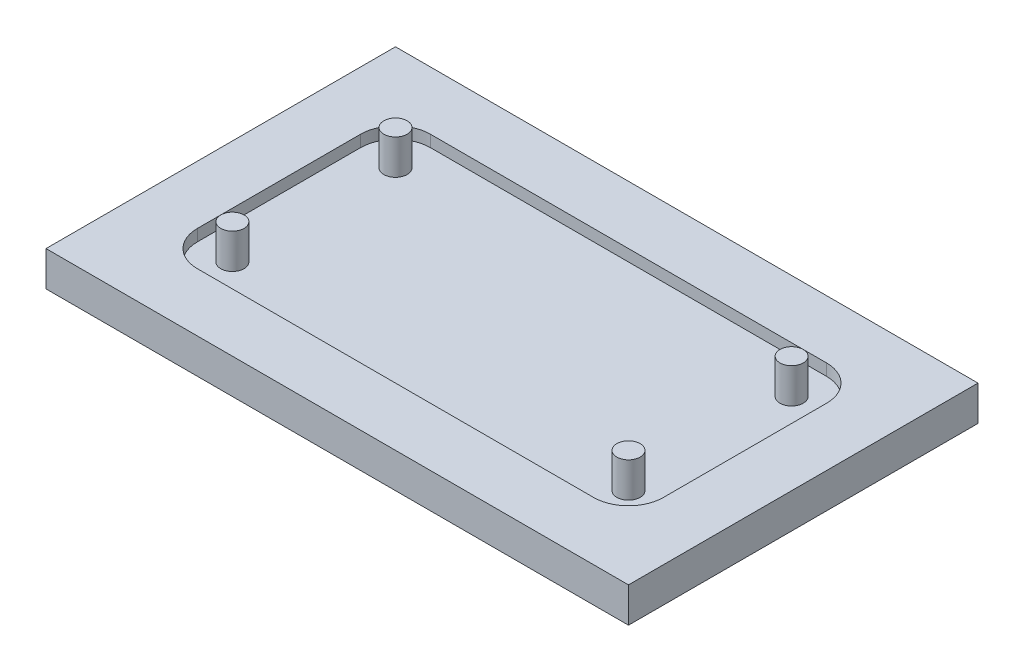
ISO-10303-21;
HEADER;
FILE_DESCRIPTION(('STEP AP214'),'2;1');
FILE_NAME('part.step','',(''),(''),'','','');
FILE_SCHEMA(('AUTOMOTIVE_DESIGN { 1 0 10303 214 1 1 1 1 }'));
ENDSEC;
DATA;
#1=APPLICATION_CONTEXT('core data for automotive mechanical design processes');
#2=APPLICATION_PROTOCOL_DEFINITION('international standard','automotive_design',2000,#1);
#3=PRODUCT_CONTEXT('',#1,'mechanical');
#4=PRODUCT('Part','Part','',(#3));
#5=PRODUCT_RELATED_PRODUCT_CATEGORY('part','',(#4));
#6=PRODUCT_DEFINITION_FORMATION('','',#4);
#7=PRODUCT_DEFINITION_CONTEXT('part definition',#1,'design');
#8=PRODUCT_DEFINITION('design','',#6,#7);
#9=PRODUCT_DEFINITION_SHAPE('','',#8);
#10=(LENGTH_UNIT() NAMED_UNIT(*) SI_UNIT(.MILLI.,.METRE.));
#11=(NAMED_UNIT(*) PLANE_ANGLE_UNIT() SI_UNIT($,.RADIAN.));
#12=(NAMED_UNIT(*) SI_UNIT($,.STERADIAN.) SOLID_ANGLE_UNIT());
#13=UNCERTAINTY_MEASURE_WITH_UNIT(LENGTH_MEASURE(1.E-05),#10,'distance_accuracy_value','');
#14=(GEOMETRIC_REPRESENTATION_CONTEXT(3) GLOBAL_UNCERTAINTY_ASSIGNED_CONTEXT((#13)) GLOBAL_UNIT_ASSIGNED_CONTEXT((#10,
#11,#12)) REPRESENTATION_CONTEXT('',''));
#15=CARTESIAN_POINT('',(0.,0.,0.));
#16=DIRECTION('',(0.,0.,1.));
#17=DIRECTION('',(1.,0.,0.));
#18=AXIS2_PLACEMENT_3D('',#15,#16,#17);
#19=CARTESIAN_POINT('',(85.,10.,-35.));
#20=DIRECTION('',(0.,-1.,0.));
#21=DIRECTION('',(0.,0.,-1.));
#22=AXIS2_PLACEMENT_3D('',#19,#20,#21);
#23=PLANE('',#22);
#24=CARTESIAN_POINT('',(84.9999999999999,10.,35.));
#25=DIRECTION('',(0.,-1.,0.));
#26=DIRECTION('',(0.,0.,-1.));
#27=AXIS2_PLACEMENT_3D('',#24,#25,#26);
#28=CIRCLE('',#27,5.00000000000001);
#29=CARTESIAN_POINT('',(84.9999999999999,10.,30.));
#30=VERTEX_POINT('',#29);
#31=EDGE_CURVE('E11',#30,#30,#28,.F.);
#32=ORIENTED_EDGE('',*,*,#31,.F.);
#33=EDGE_LOOP('',(#32));
#34=FACE_BOUND('',#33,.T.);
#35=CARTESIAN_POINT('',(84.9999999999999,10.,-35.));
#36=DIRECTION('',(0.,-1.,0.));
#37=DIRECTION('',(0.,0.,-1.));
#38=AXIS2_PLACEMENT_3D('',#35,#36,#37);
#39=CIRCLE('',#38,5.00000000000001);
#40=CARTESIAN_POINT('',(84.9999999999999,10.,-40.));
#41=VERTEX_POINT('',#40);
#42=EDGE_CURVE('E48',#41,#41,#39,.F.);
#43=ORIENTED_EDGE('',*,*,#42,.F.);
#44=EDGE_LOOP('',(#43));
#45=FACE_BOUND('',#44,.T.);
#46=CARTESIAN_POINT('',(-85.,10.,35.));
#47=DIRECTION('',(0.,-1.,0.));
#48=DIRECTION('',(0.,0.,-1.));
#49=AXIS2_PLACEMENT_3D('',#46,#47,#48);
#50=CIRCLE('',#49,5.00000000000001);
#51=CARTESIAN_POINT('',(-85.,10.,30.));
#52=VERTEX_POINT('',#51);
#53=EDGE_CURVE('E288',#52,#52,#50,.F.);
#54=ORIENTED_EDGE('',*,*,#53,.F.);
#55=EDGE_LOOP('',(#54));
#56=FACE_BOUND('',#55,.T.);
#57=CARTESIAN_POINT('',(-85.,10.,-35.));
#58=DIRECTION('',(0.,-1.,0.));
#59=DIRECTION('',(0.,0.,-1.));
#60=AXIS2_PLACEMENT_3D('',#57,#58,#59);
#61=CIRCLE('',#60,5.00000000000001);
#62=CARTESIAN_POINT('',(-85.,10.,-40.));
#63=VERTEX_POINT('',#62);
#64=EDGE_CURVE('E284',#63,#63,#61,.F.);
#65=ORIENTED_EDGE('',*,*,#64,.F.);
#66=EDGE_LOOP('',(#65));
#67=FACE_BOUND('',#66,.T.);
#68=DIRECTION('',(1.,0.,0.));
#69=VECTOR('',#68,1.);
#70=CARTESIAN_POINT('',(-84.9999999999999,10.,-50.));
#71=LINE('',#70,#69);
#72=CARTESIAN_POINT('',(-85.,10.,-50.));
#73=VERTEX_POINT('',#72);
#74=CARTESIAN_POINT('',(84.9999999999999,10.,-50.));
#75=VERTEX_POINT('',#74);
#76=EDGE_CURVE('E55',#73,#75,#71,.T.);
#77=ORIENTED_EDGE('',*,*,#76,.F.);
#78=CARTESIAN_POINT('',(-85.,10.,-35.));
#79=DIRECTION('',(0.,-1.,0.));
#80=DIRECTION('',(0.,0.,-1.));
#81=AXIS2_PLACEMENT_3D('',#78,#79,#80);
#82=CIRCLE('',#81,15.);
#83=CARTESIAN_POINT('',(-100.,10.,-34.9999999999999));
#84=VERTEX_POINT('',#83);
#85=EDGE_CURVE('E59',#84,#73,#82,.T.);
#86=ORIENTED_EDGE('',*,*,#85,.F.);
#87=DIRECTION('',(0.,0.,-1.));
#88=VECTOR('',#87,1.);
#89=CARTESIAN_POINT('',(-100.,10.,34.9999999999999));
#90=LINE('',#89,#88);
#91=CARTESIAN_POINT('',(-100.,10.,34.9999999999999));
#92=VERTEX_POINT('',#91);
#93=EDGE_CURVE('E279',#92,#84,#90,.T.);
#94=ORIENTED_EDGE('',*,*,#93,.F.);
#95=CARTESIAN_POINT('',(-85.,10.,35.));
#96=DIRECTION('',(0.,-1.,0.));
#97=DIRECTION('',(0.,0.,-1.));
#98=AXIS2_PLACEMENT_3D('',#95,#96,#97);
#99=CIRCLE('',#98,15.);
#100=CARTESIAN_POINT('',(-84.9999999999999,10.,50.));
#101=VERTEX_POINT('',#100);
#102=EDGE_CURVE('E275',#101,#92,#99,.T.);
#103=ORIENTED_EDGE('',*,*,#102,.F.);
#104=DIRECTION('',(1.,0.,0.));
#105=VECTOR('',#104,1.);
#106=CARTESIAN_POINT('',(-84.9999999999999,10.,50.));
#107=LINE('',#106,#105);
#108=CARTESIAN_POINT('',(84.9999999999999,10.,50.));
#109=VERTEX_POINT('',#108);
#110=EDGE_CURVE('E272',#101,#109,#107,.T.);
#111=ORIENTED_EDGE('',*,*,#110,.T.);
#112=CARTESIAN_POINT('',(85.,10.,35.));
#113=DIRECTION('',(0.,1.,0.));
#114=DIRECTION('',(0.,0.,1.));
#115=AXIS2_PLACEMENT_3D('',#112,#113,#114);
#116=CIRCLE('',#115,15.);
#117=CARTESIAN_POINT('',(100.,10.,34.9999999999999));
#118=VERTEX_POINT('',#117);
#119=EDGE_CURVE('E269',#109,#118,#116,.T.);
#120=ORIENTED_EDGE('',*,*,#119,.T.);
#121=DIRECTION('',(0.,0.,-1.));
#122=VECTOR('',#121,1.);
#123=CARTESIAN_POINT('',(100.,10.,34.9999999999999));
#124=LINE('',#123,#122);
#125=CARTESIAN_POINT('',(100.,10.,-34.9999999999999));
#126=VERTEX_POINT('',#125);
#127=EDGE_CURVE('E266',#118,#126,#124,.T.);
#128=ORIENTED_EDGE('',*,*,#127,.T.);
#129=CARTESIAN_POINT('',(85.,10.,-35.));
#130=DIRECTION('',(0.,-1.,0.));
#131=DIRECTION('',(0.,0.,-1.));
#132=AXIS2_PLACEMENT_3D('',#129,#130,#131);
#133=CIRCLE('',#132,15.);
#134=EDGE_CURVE('E262',#75,#126,#133,.T.);
#135=ORIENTED_EDGE('',*,*,#134,.F.);
#136=EDGE_LOOP('',(#77,#86,#94,#103,#111,#120,#128,#135));
#137=FACE_BOUND('',#136,.T.);
#138=ADVANCED_FACE('F39',(#34,#45,#56,#67,#137),#23,.F.);
#139=CARTESIAN_POINT('',(-85.,25.,-35.));
#140=DIRECTION('',(0.,-1.,0.));
#141=DIRECTION('',(0.,0.,-1.));
#142=AXIS2_PLACEMENT_3D('',#139,#140,#141);
#143=CYLINDRICAL_SURFACE('',#142,5.00000000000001);
#144=CARTESIAN_POINT('',(-85.,25.,-35.));
#145=DIRECTION('',(0.,1.,0.));
#146=DIRECTION('',(0.,0.,1.));
#147=AXIS2_PLACEMENT_3D('',#144,#145,#146);
#148=CIRCLE('',#147,5.00000000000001);
#149=CARTESIAN_POINT('',(-85.,25.,-30.));
#150=VERTEX_POINT('',#149);
#151=EDGE_CURVE('E256',#150,#150,#148,.T.);
#152=ORIENTED_EDGE('',*,*,#151,.F.);
#153=EDGE_LOOP('',(#152));
#154=FACE_BOUND('',#153,.T.);
#155=ORIENTED_EDGE('',*,*,#64,.T.);
#156=EDGE_LOOP('',(#155));
#157=FACE_BOUND('',#156,.T.);
#158=ADVANCED_FACE('F299',(#154,#157),#143,.T.);
#159=CARTESIAN_POINT('',(-85.,25.,-35.));
#160=DIRECTION('',(0.,1.,0.));
#161=DIRECTION('',(0.,0.,1.));
#162=AXIS2_PLACEMENT_3D('',#159,#160,#161);
#163=PLANE('',#162);
#164=ORIENTED_EDGE('',*,*,#151,.T.);
#165=EDGE_LOOP('',(#164));
#166=FACE_BOUND('',#165,.T.);
#167=ADVANCED_FACE('F306',(#166),#163,.T.);
#168=CARTESIAN_POINT('',(-85.,25.,35.));
#169=DIRECTION('',(0.,-1.,0.));
#170=DIRECTION('',(0.,0.,-1.));
#171=AXIS2_PLACEMENT_3D('',#168,#169,#170);
#172=CYLINDRICAL_SURFACE('',#171,5.00000000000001);
#173=CARTESIAN_POINT('',(-85.,25.,35.));
#174=DIRECTION('',(0.,1.,0.));
#175=DIRECTION('',(0.,0.,1.));
#176=AXIS2_PLACEMENT_3D('',#173,#174,#175);
#177=CIRCLE('',#176,5.00000000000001);
#178=CARTESIAN_POINT('',(-85.,25.,40.));
#179=VERTEX_POINT('',#178);
#180=EDGE_CURVE('E252',#179,#179,#177,.T.);
#181=ORIENTED_EDGE('',*,*,#180,.F.);
#182=EDGE_LOOP('',(#181));
#183=FACE_BOUND('',#182,.T.);
#184=ORIENTED_EDGE('',*,*,#53,.T.);
#185=EDGE_LOOP('',(#184));
#186=FACE_BOUND('',#185,.T.);
#187=ADVANCED_FACE('F312',(#183,#186),#172,.T.);
#188=CARTESIAN_POINT('',(-85.,25.,35.));
#189=DIRECTION('',(0.,1.,0.));
#190=DIRECTION('',(0.,0.,1.));
#191=AXIS2_PLACEMENT_3D('',#188,#189,#190);
#192=PLANE('',#191);
#193=ORIENTED_EDGE('',*,*,#180,.T.);
#194=EDGE_LOOP('',(#193));
#195=FACE_BOUND('',#194,.T.);
#196=ADVANCED_FACE('F319',(#195),#192,.T.);
#197=CARTESIAN_POINT('',(84.9999999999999,25.,-35.));
#198=DIRECTION('',(0.,-1.,0.));
#199=DIRECTION('',(0.,0.,-1.));
#200=AXIS2_PLACEMENT_3D('',#197,#198,#199);
#201=CYLINDRICAL_SURFACE('',#200,5.00000000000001);
#202=CARTESIAN_POINT('',(84.9999999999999,25.,-35.));
#203=DIRECTION('',(0.,1.,0.));
#204=DIRECTION('',(0.,0.,1.));
#205=AXIS2_PLACEMENT_3D('',#202,#203,#204);
#206=CIRCLE('',#205,5.00000000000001);
#207=CARTESIAN_POINT('',(84.9999999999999,25.,-30.));
#208=VERTEX_POINT('',#207);
#209=EDGE_CURVE('E248',#208,#208,#206,.T.);
#210=ORIENTED_EDGE('',*,*,#209,.F.);
#211=EDGE_LOOP('',(#210));
#212=FACE_BOUND('',#211,.T.);
#213=ORIENTED_EDGE('',*,*,#42,.T.);
#214=EDGE_LOOP('',(#213));
#215=FACE_BOUND('',#214,.T.);
#216=ADVANCED_FACE('F295',(#212,#215),#201,.T.);
#217=CARTESIAN_POINT('',(84.9999999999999,25.,-35.));
#218=DIRECTION('',(0.,1.,0.));
#219=DIRECTION('',(0.,0.,1.));
#220=AXIS2_PLACEMENT_3D('',#217,#218,#219);
#221=PLANE('',#220);
#222=ORIENTED_EDGE('',*,*,#209,.T.);
#223=EDGE_LOOP('',(#222));
#224=FACE_BOUND('',#223,.T.);
#225=ADVANCED_FACE('F326',(#224),#221,.T.);
#226=CARTESIAN_POINT('',(84.9999999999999,25.,35.));
#227=DIRECTION('',(0.,-1.,0.));
#228=DIRECTION('',(0.,0.,-1.));
#229=AXIS2_PLACEMENT_3D('',#226,#227,#228);
#230=CYLINDRICAL_SURFACE('',#229,5.00000000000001);
#231=CARTESIAN_POINT('',(84.9999999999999,25.,35.));
#232=DIRECTION('',(0.,1.,0.));
#233=DIRECTION('',(0.,0.,1.));
#234=AXIS2_PLACEMENT_3D('',#231,#232,#233);
#235=CIRCLE('',#234,5.00000000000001);
#236=CARTESIAN_POINT('',(84.9999999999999,25.,40.));
#237=VERTEX_POINT('',#236);
#238=EDGE_CURVE('E236',#237,#237,#235,.T.);
#239=ORIENTED_EDGE('',*,*,#238,.F.);
#240=EDGE_LOOP('',(#239));
#241=FACE_BOUND('',#240,.T.);
#242=ORIENTED_EDGE('',*,*,#31,.T.);
#243=EDGE_LOOP('',(#242));
#244=FACE_BOUND('',#243,.T.);
#245=ADVANCED_FACE('F330',(#241,#244),#230,.T.);
#246=CARTESIAN_POINT('',(84.9999999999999,25.,35.));
#247=DIRECTION('',(0.,1.,0.));
#248=DIRECTION('',(0.,0.,1.));
#249=AXIS2_PLACEMENT_3D('',#246,#247,#248);
#250=PLANE('',#249);
#251=ORIENTED_EDGE('',*,*,#238,.T.);
#252=EDGE_LOOP('',(#251));
#253=FACE_BOUND('',#252,.T.);
#254=ADVANCED_FACE('F334',(#253),#250,.T.);
#255=CARTESIAN_POINT('',(-85.,15.,-35.));
#256=DIRECTION('',(0.,-1.,0.));
#257=DIRECTION('',(0.,0.,-1.));
#258=AXIS2_PLACEMENT_3D('',#255,#256,#257);
#259=CYLINDRICAL_SURFACE('',#258,15.);
#260=DIRECTION('',(0.,-1.,0.));
#261=VECTOR('',#260,1.);
#262=CARTESIAN_POINT('',(-100.,15.,-34.9999999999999));
#263=LINE('',#262,#261);
#264=CARTESIAN_POINT('',(-100.,15.,-34.9999999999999));
#265=VERTEX_POINT('',#264);
#266=EDGE_CURVE('E175',#265,#84,#263,.T.);
#267=ORIENTED_EDGE('',*,*,#266,.T.);
#268=ORIENTED_EDGE('',*,*,#85,.T.);
#269=DIRECTION('',(0.,-1.,0.));
#270=VECTOR('',#269,1.);
#271=CARTESIAN_POINT('',(-85.,15.,-50.));
#272=LINE('',#271,#270);
#273=CARTESIAN_POINT('',(-85.,15.,-50.));
#274=VERTEX_POINT('',#273);
#275=EDGE_CURVE('E127',#274,#73,#272,.T.);
#276=ORIENTED_EDGE('',*,*,#275,.F.);
#277=CARTESIAN_POINT('',(-85.,15.,-35.));
#278=DIRECTION('',(0.,-1.,0.));
#279=DIRECTION('',(0.,0.,-1.));
#280=AXIS2_PLACEMENT_3D('',#277,#278,#279);
#281=CIRCLE('',#280,15.);
#282=EDGE_CURVE('E132',#265,#274,#281,.T.);
#283=ORIENTED_EDGE('',*,*,#282,.F.);
#284=EDGE_LOOP('',(#267,#268,#276,#283));
#285=FACE_BOUND('',#284,.T.);
#286=ADVANCED_FACE('F130',(#285),#259,.F.);
#287=CARTESIAN_POINT('',(-100.,15.,34.9999999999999));
#288=DIRECTION('',(-1.,0.,0.));
#289=DIRECTION('',(0.,0.,1.));
#290=AXIS2_PLACEMENT_3D('',#287,#288,#289);
#291=PLANE('',#290);
#292=DIRECTION('',(0.,-1.,0.));
#293=VECTOR('',#292,1.);
#294=CARTESIAN_POINT('',(-100.,15.,34.9999999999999));
#295=LINE('',#294,#293);
#296=CARTESIAN_POINT('',(-100.,15.,34.9999999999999));
#297=VERTEX_POINT('',#296);
#298=EDGE_CURVE('E179',#297,#92,#295,.T.);
#299=ORIENTED_EDGE('',*,*,#298,.T.);
#300=ORIENTED_EDGE('',*,*,#93,.T.);
#301=ORIENTED_EDGE('',*,*,#266,.F.);
#302=DIRECTION('',(0.,0.,-1.));
#303=VECTOR('',#302,1.);
#304=CARTESIAN_POINT('',(-100.,15.,34.9999999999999));
#305=LINE('',#304,#303);
#306=EDGE_CURVE('E137',#297,#265,#305,.T.);
#307=ORIENTED_EDGE('',*,*,#306,.F.);
#308=EDGE_LOOP('',(#299,#300,#301,#307));
#309=FACE_BOUND('',#308,.T.);
#310=ADVANCED_FACE('F359',(#309),#291,.F.);
#311=CARTESIAN_POINT('',(-85.,15.,35.));
#312=DIRECTION('',(0.,-1.,0.));
#313=DIRECTION('',(0.,0.,-1.));
#314=AXIS2_PLACEMENT_3D('',#311,#312,#313);
#315=CYLINDRICAL_SURFACE('',#314,15.);
#316=DIRECTION('',(0.,-1.,0.));
#317=VECTOR('',#316,1.);
#318=CARTESIAN_POINT('',(-84.9999999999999,15.,50.));
#319=LINE('',#318,#317);
#320=CARTESIAN_POINT('',(-84.9999999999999,15.,50.));
#321=VERTEX_POINT('',#320);
#322=EDGE_CURVE('E183',#321,#101,#319,.T.);
#323=ORIENTED_EDGE('',*,*,#322,.T.);
#324=ORIENTED_EDGE('',*,*,#102,.T.);
#325=ORIENTED_EDGE('',*,*,#298,.F.);
#326=CARTESIAN_POINT('',(-85.,15.,35.));
#327=DIRECTION('',(0.,-1.,0.));
#328=DIRECTION('',(0.,0.,-1.));
#329=AXIS2_PLACEMENT_3D('',#326,#327,#328);
#330=CIRCLE('',#329,15.);
#331=EDGE_CURVE('E170',#321,#297,#330,.T.);
#332=ORIENTED_EDGE('',*,*,#331,.F.);
#333=EDGE_LOOP('',(#323,#324,#325,#332));
#334=FACE_BOUND('',#333,.T.);
#335=ADVANCED_FACE('F377',(#334),#315,.F.);
#336=CARTESIAN_POINT('',(84.9999999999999,15.,50.));
#337=DIRECTION('',(0.,0.,1.));
#338=DIRECTION('',(1.,0.,0.));
#339=AXIS2_PLACEMENT_3D('',#336,#337,#338);
#340=PLANE('',#339);
#341=DIRECTION('',(0.,-1.,0.));
#342=VECTOR('',#341,1.);
#343=CARTESIAN_POINT('',(84.9999999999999,15.,50.));
#344=LINE('',#343,#342);
#345=CARTESIAN_POINT('',(84.9999999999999,15.,50.));
#346=VERTEX_POINT('',#345);
#347=EDGE_CURVE('E187',#346,#109,#344,.T.);
#348=ORIENTED_EDGE('',*,*,#347,.T.);
#349=ORIENTED_EDGE('',*,*,#110,.F.);
#350=ORIENTED_EDGE('',*,*,#322,.F.);
#351=DIRECTION('',(-1.,0.,0.));
#352=VECTOR('',#351,1.);
#353=CARTESIAN_POINT('',(84.9999999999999,15.,50.));
#354=LINE('',#353,#352);
#355=EDGE_CURVE('E166',#346,#321,#354,.T.);
#356=ORIENTED_EDGE('',*,*,#355,.F.);
#357=EDGE_LOOP('',(#348,#349,#350,#356));
#358=FACE_BOUND('',#357,.T.);
#359=ADVANCED_FACE('F373',(#358),#340,.F.);
#360=CARTESIAN_POINT('',(85.,15.,35.));
#361=DIRECTION('',(0.,-1.,0.));
#362=DIRECTION('',(0.,0.,-1.));
#363=AXIS2_PLACEMENT_3D('',#360,#361,#362);
#364=CYLINDRICAL_SURFACE('',#363,15.);
#365=DIRECTION('',(0.,-1.,0.));
#366=VECTOR('',#365,1.);
#367=CARTESIAN_POINT('',(100.,15.,34.9999999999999));
#368=LINE('',#367,#366);
#369=CARTESIAN_POINT('',(100.,15.,34.9999999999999));
#370=VERTEX_POINT('',#369);
#371=EDGE_CURVE('E191',#370,#118,#368,.T.);
#372=ORIENTED_EDGE('',*,*,#371,.T.);
#373=ORIENTED_EDGE('',*,*,#119,.F.);
#374=ORIENTED_EDGE('',*,*,#347,.F.);
#375=CARTESIAN_POINT('',(85.,15.,35.));
#376=DIRECTION('',(0.,-1.,0.));
#377=DIRECTION('',(0.,0.,-1.));
#378=AXIS2_PLACEMENT_3D('',#375,#376,#377);
#379=CIRCLE('',#378,15.);
#380=EDGE_CURVE('E162',#370,#346,#379,.T.);
#381=ORIENTED_EDGE('',*,*,#380,.F.);
#382=EDGE_LOOP('',(#372,#373,#374,#381));
#383=FACE_BOUND('',#382,.T.);
#384=ADVANCED_FACE('F369',(#383),#364,.F.);
#385=CARTESIAN_POINT('',(100.,15.,-35.));
#386=DIRECTION('',(1.,0.,0.));
#387=DIRECTION('',(0.,0.,-1.));
#388=AXIS2_PLACEMENT_3D('',#385,#386,#387);
#389=PLANE('',#388);
#390=DIRECTION('',(0.,-1.,0.));
#391=VECTOR('',#390,1.);
#392=CARTESIAN_POINT('',(100.,15.,-35.));
#393=LINE('',#392,#391);
#394=CARTESIAN_POINT('',(100.,15.,-35.));
#395=VERTEX_POINT('',#394);
#396=EDGE_CURVE('E195',#395,#126,#393,.T.);
#397=ORIENTED_EDGE('',*,*,#396,.T.);
#398=ORIENTED_EDGE('',*,*,#127,.F.);
#399=ORIENTED_EDGE('',*,*,#371,.F.);
#400=DIRECTION('',(0.,0.,1.));
#401=VECTOR('',#400,1.);
#402=CARTESIAN_POINT('',(100.,15.,-35.));
#403=LINE('',#402,#401);
#404=EDGE_CURVE('E158',#395,#370,#403,.T.);
#405=ORIENTED_EDGE('',*,*,#404,.F.);
#406=EDGE_LOOP('',(#397,#398,#399,#405));
#407=FACE_BOUND('',#406,.T.);
#408=ADVANCED_FACE('F365',(#407),#389,.F.);
#409=CARTESIAN_POINT('',(85.,15.,-35.));
#410=DIRECTION('',(0.,-1.,0.));
#411=DIRECTION('',(0.,0.,-1.));
#412=AXIS2_PLACEMENT_3D('',#409,#410,#411);
#413=CYLINDRICAL_SURFACE('',#412,15.);
#414=DIRECTION('',(0.,-1.,0.));
#415=VECTOR('',#414,1.);
#416=CARTESIAN_POINT('',(84.9999999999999,15.,-50.));
#417=LINE('',#416,#415);
#418=CARTESIAN_POINT('',(84.9999999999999,15.,-50.));
#419=VERTEX_POINT('',#418);
#420=EDGE_CURVE('E136',#419,#75,#417,.T.);
#421=ORIENTED_EDGE('',*,*,#420,.T.);
#422=ORIENTED_EDGE('',*,*,#134,.T.);
#423=ORIENTED_EDGE('',*,*,#396,.F.);
#424=CARTESIAN_POINT('',(85.,15.,-35.));
#425=DIRECTION('',(0.,-1.,0.));
#426=DIRECTION('',(0.,0.,-1.));
#427=AXIS2_PLACEMENT_3D('',#424,#425,#426);
#428=CIRCLE('',#427,15.);
#429=EDGE_CURVE('E147',#419,#395,#428,.T.);
#430=ORIENTED_EDGE('',*,*,#429,.F.);
#431=EDGE_LOOP('',(#421,#422,#423,#430));
#432=FACE_BOUND('',#431,.T.);
#433=ADVANCED_FACE('F362',(#432),#413,.F.);
#434=CARTESIAN_POINT('',(-85.,15.,-50.));
#435=DIRECTION('',(0.,0.,-1.));
#436=DIRECTION('',(-1.,0.,0.));
#437=AXIS2_PLACEMENT_3D('',#434,#435,#436);
#438=PLANE('',#437);
#439=ORIENTED_EDGE('',*,*,#275,.T.);
#440=ORIENTED_EDGE('',*,*,#76,.T.);
#441=ORIENTED_EDGE('',*,*,#420,.F.);
#442=DIRECTION('',(1.,0.,0.));
#443=VECTOR('',#442,1.);
#444=CARTESIAN_POINT('',(-85.,15.,-50.));
#445=LINE('',#444,#443);
#446=EDGE_CURVE('E141',#274,#419,#445,.T.);
#447=ORIENTED_EDGE('',*,*,#446,.F.);
#448=EDGE_LOOP('',(#439,#440,#441,#447));
#449=FACE_BOUND('',#448,.T.);
#450=ADVANCED_FACE('F142',(#449),#438,.F.);
#451=CARTESIAN_POINT('',(125.,15.,-75.));
#452=DIRECTION('',(1.,0.,0.));
#453=DIRECTION('',(0.,0.,-1.));
#454=AXIS2_PLACEMENT_3D('',#451,#452,#453);
#455=PLANE('',#454);
#456=DIRECTION('',(0.,0.,1.));
#457=VECTOR('',#456,1.);
#458=CARTESIAN_POINT('',(125.,0.,-75.));
#459=LINE('',#458,#457);
#460=CARTESIAN_POINT('',(125.,0.,-75.));
#461=VERTEX_POINT('',#460);
#462=CARTESIAN_POINT('',(125.,0.,75.));
#463=VERTEX_POINT('',#462);
#464=EDGE_CURVE('E178',#461,#463,#459,.T.);
#465=ORIENTED_EDGE('',*,*,#464,.F.);
#466=DIRECTION('',(0.,-1.,0.));
#467=VECTOR('',#466,1.);
#468=CARTESIAN_POINT('',(125.,15.,-75.));
#469=LINE('',#468,#467);
#470=CARTESIAN_POINT('',(125.,15.,-75.));
#471=VERTEX_POINT('',#470);
#472=EDGE_CURVE('E233',#471,#461,#469,.T.);
#473=ORIENTED_EDGE('',*,*,#472,.F.);
#474=DIRECTION('',(0.,0.,1.));
#475=VECTOR('',#474,1.);
#476=CARTESIAN_POINT('',(125.,15.,-75.));
#477=LINE('',#476,#475);
#478=CARTESIAN_POINT('',(125.,15.,75.));
#479=VERTEX_POINT('',#478);
#480=EDGE_CURVE('E201',#471,#479,#477,.T.);
#481=ORIENTED_EDGE('',*,*,#480,.T.);
#482=DIRECTION('',(0.,-1.,0.));
#483=VECTOR('',#482,1.);
#484=CARTESIAN_POINT('',(125.,15.,75.));
#485=LINE('',#484,#483);
#486=EDGE_CURVE('E218',#479,#463,#485,.T.);
#487=ORIENTED_EDGE('',*,*,#486,.T.);
#488=EDGE_LOOP('',(#465,#473,#481,#487));
#489=FACE_BOUND('',#488,.T.);
#490=ADVANCED_FACE('F339',(#489),#455,.T.);
#491=CARTESIAN_POINT('',(-125.,15.,-75.));
#492=DIRECTION('',(0.,0.,-1.));
#493=DIRECTION('',(-1.,0.,0.));
#494=AXIS2_PLACEMENT_3D('',#491,#492,#493);
#495=PLANE('',#494);
#496=DIRECTION('',(1.,0.,0.));
#497=VECTOR('',#496,1.);
#498=CARTESIAN_POINT('',(-125.,0.,-75.));
#499=LINE('',#498,#497);
#500=CARTESIAN_POINT('',(-125.,0.,-75.));
#501=VERTEX_POINT('',#500);
#502=EDGE_CURVE('E206',#501,#461,#499,.T.);
#503=ORIENTED_EDGE('',*,*,#502,.F.);
#504=DIRECTION('',(0.,-1.,0.));
#505=VECTOR('',#504,1.);
#506=CARTESIAN_POINT('',(-125.,15.,-75.));
#507=LINE('',#506,#505);
#508=CARTESIAN_POINT('',(-125.,15.,-75.));
#509=VERTEX_POINT('',#508);
#510=EDGE_CURVE('E237',#509,#501,#507,.T.);
#511=ORIENTED_EDGE('',*,*,#510,.F.);
#512=DIRECTION('',(1.,0.,0.));
#513=VECTOR('',#512,1.);
#514=CARTESIAN_POINT('',(-125.,15.,-75.));
#515=LINE('',#514,#513);
#516=EDGE_CURVE('E214',#509,#471,#515,.T.);
#517=ORIENTED_EDGE('',*,*,#516,.T.);
#518=ORIENTED_EDGE('',*,*,#472,.T.);
#519=EDGE_LOOP('',(#503,#511,#517,#518));
#520=FACE_BOUND('',#519,.T.);
#521=ADVANCED_FACE('F342',(#520),#495,.T.);
#522=CARTESIAN_POINT('',(-125.,15.,-75.));
#523=DIRECTION('',(-1.,0.,0.));
#524=DIRECTION('',(0.,0.,1.));
#525=AXIS2_PLACEMENT_3D('',#522,#523,#524);
#526=PLANE('',#525);
#527=DIRECTION('',(0.,0.,-1.));
#528=VECTOR('',#527,1.);
#529=CARTESIAN_POINT('',(-125.,0.,-75.));
#530=LINE('',#529,#528);
#531=CARTESIAN_POINT('',(-125.,0.,75.));
#532=VERTEX_POINT('',#531);
#533=EDGE_CURVE('E226',#532,#501,#530,.T.);
#534=ORIENTED_EDGE('',*,*,#533,.F.);
#535=DIRECTION('',(0.,-1.,0.));
#536=VECTOR('',#535,1.);
#537=CARTESIAN_POINT('',(-125.,15.,75.));
#538=LINE('',#537,#536);
#539=CARTESIAN_POINT('',(-125.,15.,75.));
#540=VERTEX_POINT('',#539);
#541=EDGE_CURVE('E240',#540,#532,#538,.T.);
#542=ORIENTED_EDGE('',*,*,#541,.F.);
#543=DIRECTION('',(0.,0.,-1.));
#544=VECTOR('',#543,1.);
#545=CARTESIAN_POINT('',(-125.,15.,-75.));
#546=LINE('',#545,#544);
#547=EDGE_CURVE('E210',#540,#509,#546,.T.);
#548=ORIENTED_EDGE('',*,*,#547,.T.);
#549=ORIENTED_EDGE('',*,*,#510,.T.);
#550=EDGE_LOOP('',(#534,#542,#548,#549));
#551=FACE_BOUND('',#550,.T.);
#552=ADVANCED_FACE('F347',(#551),#526,.T.);
#553=CARTESIAN_POINT('',(-125.,15.,75.));
#554=DIRECTION('',(0.,0.,1.));
#555=DIRECTION('',(1.,0.,0.));
#556=AXIS2_PLACEMENT_3D('',#553,#554,#555);
#557=PLANE('',#556);
#558=DIRECTION('',(-1.,0.,0.));
#559=VECTOR('',#558,1.);
#560=CARTESIAN_POINT('',(-125.,0.,75.));
#561=LINE('',#560,#559);
#562=EDGE_CURVE('E222',#463,#532,#561,.T.);
#563=ORIENTED_EDGE('',*,*,#562,.F.);
#564=ORIENTED_EDGE('',*,*,#486,.F.);
#565=DIRECTION('',(-1.,0.,0.));
#566=VECTOR('',#565,1.);
#567=CARTESIAN_POINT('',(-125.,15.,75.));
#568=LINE('',#567,#566);
#569=EDGE_CURVE('E205',#479,#540,#568,.T.);
#570=ORIENTED_EDGE('',*,*,#569,.T.);
#571=ORIENTED_EDGE('',*,*,#541,.T.);
#572=EDGE_LOOP('',(#563,#564,#570,#571));
#573=FACE_BOUND('',#572,.T.);
#574=ADVANCED_FACE('F344',(#573),#557,.T.);
#575=CARTESIAN_POINT('',(0.,15.,0.));
#576=DIRECTION('',(0.,1.,0.));
#577=DIRECTION('',(0.,0.,1.));
#578=AXIS2_PLACEMENT_3D('',#575,#576,#577);
#579=PLANE('',#578);
#580=ORIENTED_EDGE('',*,*,#282,.T.);
#581=ORIENTED_EDGE('',*,*,#446,.T.);
#582=ORIENTED_EDGE('',*,*,#429,.T.);
#583=ORIENTED_EDGE('',*,*,#404,.T.);
#584=ORIENTED_EDGE('',*,*,#380,.T.);
#585=ORIENTED_EDGE('',*,*,#355,.T.);
#586=ORIENTED_EDGE('',*,*,#331,.T.);
#587=ORIENTED_EDGE('',*,*,#306,.T.);
#588=EDGE_LOOP('',(#580,#581,#582,#583,#584,#585,#586,#587));
#589=FACE_BOUND('',#588,.T.);
#590=ORIENTED_EDGE('',*,*,#480,.F.);
#591=ORIENTED_EDGE('',*,*,#516,.F.);
#592=ORIENTED_EDGE('',*,*,#547,.F.);
#593=ORIENTED_EDGE('',*,*,#569,.F.);
#594=EDGE_LOOP('',(#590,#591,#592,#593));
#595=FACE_BOUND('',#594,.T.);
#596=ADVANCED_FACE('F149',(#589,#595),#579,.T.);
#597=CARTESIAN_POINT('',(85.,0.,-35.));
#598=DIRECTION('',(0.,-1.,0.));
#599=DIRECTION('',(0.,0.,-1.));
#600=AXIS2_PLACEMENT_3D('',#597,#598,#599);
#601=PLANE('',#600);
#602=ORIENTED_EDGE('',*,*,#464,.T.);
#603=ORIENTED_EDGE('',*,*,#562,.T.);
#604=ORIENTED_EDGE('',*,*,#533,.T.);
#605=ORIENTED_EDGE('',*,*,#502,.T.);
#606=EDGE_LOOP('',(#602,#603,#604,#605));
#607=FACE_BOUND('',#606,.T.);
#608=ADVANCED_FACE('F41',(#607),#601,.T.);
#609=CLOSED_SHELL('',(#138,#158,#167,#187,#196,#216,#225,#245,#254,#286,#310,#335,#359,#384,
#408,#433,#450,#490,#521,#552,#574,#596,#608));
#610=MANIFOLD_SOLID_BREP('B2',#609);
#611=ADVANCED_BREP_SHAPE_REPRESENTATION('',(#18,#610),#14);
#612=SHAPE_DEFINITION_REPRESENTATION(#9,#611);
ENDSEC;
END-ISO-10303-21;
